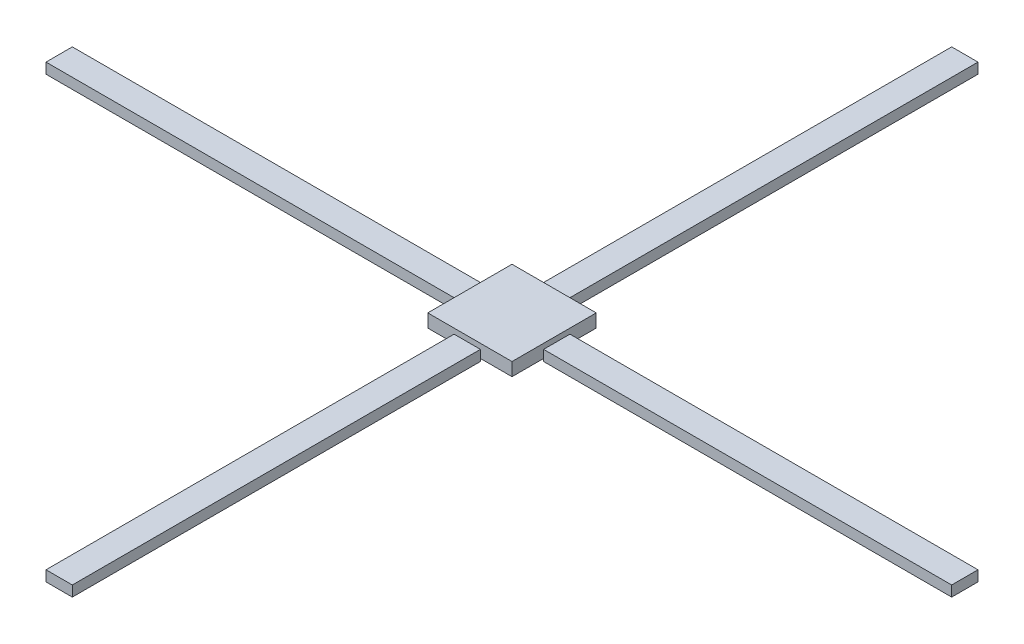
ISO-10303-21;
HEADER;
FILE_DESCRIPTION(('STEP AP214'),'2;1');
FILE_NAME('part.step','',(''),(''),'','','');
FILE_SCHEMA(('AUTOMOTIVE_DESIGN { 1 0 10303 214 1 1 1 1 }'));
ENDSEC;
DATA;
#1=APPLICATION_CONTEXT('core data for automotive mechanical design processes');
#2=APPLICATION_PROTOCOL_DEFINITION('international standard','automotive_design',2000,#1);
#3=PRODUCT_CONTEXT('',#1,'mechanical');
#4=PRODUCT('Part','Part','',(#3));
#5=PRODUCT_RELATED_PRODUCT_CATEGORY('part','',(#4));
#6=PRODUCT_DEFINITION_FORMATION('','',#4);
#7=PRODUCT_DEFINITION_CONTEXT('part definition',#1,'design');
#8=PRODUCT_DEFINITION('design','',#6,#7);
#9=PRODUCT_DEFINITION_SHAPE('','',#8);
#10=(LENGTH_UNIT() NAMED_UNIT(*) SI_UNIT(.MILLI.,.METRE.));
#11=(NAMED_UNIT(*) PLANE_ANGLE_UNIT() SI_UNIT($,.RADIAN.));
#12=(NAMED_UNIT(*) SI_UNIT($,.STERADIAN.) SOLID_ANGLE_UNIT());
#13=UNCERTAINTY_MEASURE_WITH_UNIT(LENGTH_MEASURE(1.E-05),#10,'distance_accuracy_value','');
#14=(GEOMETRIC_REPRESENTATION_CONTEXT(3) GLOBAL_UNCERTAINTY_ASSIGNED_CONTEXT((#13)) GLOBAL_UNIT_ASSIGNED_CONTEXT((#10,
#11,#12)) REPRESENTATION_CONTEXT('',''));
#15=CARTESIAN_POINT('',(0.,0.,0.));
#16=DIRECTION('',(0.,0.,1.));
#17=DIRECTION('',(1.,0.,0.));
#18=AXIS2_PLACEMENT_3D('',#15,#16,#17);
#19=CARTESIAN_POINT('',(-8000.,2500.,8000.));
#20=DIRECTION('',(1.,0.,0.));
#21=DIRECTION('',(0.,0.,-1.));
#22=AXIS2_PLACEMENT_3D('',#19,#20,#21);
#23=PLANE('',#22);
#24=DIRECTION('',(0.,0.,1.));
#25=VECTOR('',#24,1.);
#26=CARTESIAN_POINT('',(-8000.,0.,8000.));
#27=LINE('',#26,#25);
#28=CARTESIAN_POINT('',(-8000.,0.,-8000.));
#29=VERTEX_POINT('',#28);
#30=CARTESIAN_POINT('',(-8000.,0.,8000.));
#31=VERTEX_POINT('',#30);
#32=EDGE_CURVE('E114',#29,#31,#27,.T.);
#33=ORIENTED_EDGE('',*,*,#32,.T.);
#34=DIRECTION('',(0.,-1.,0.));
#35=VECTOR('',#34,1.);
#36=CARTESIAN_POINT('',(-8000.,2500.,8000.));
#37=LINE('',#36,#35);
#38=CARTESIAN_POINT('',(-8000.,2500.,8000.));
#39=VERTEX_POINT('',#38);
#40=EDGE_CURVE('E12',#39,#31,#37,.T.);
#41=ORIENTED_EDGE('',*,*,#40,.F.);
#42=DIRECTION('',(0.,0.,1.));
#43=VECTOR('',#42,1.);
#44=CARTESIAN_POINT('',(-8000.,2500.,8000.));
#45=LINE('',#44,#43);
#46=CARTESIAN_POINT('',(-8000.,2500.,-8000.));
#47=VERTEX_POINT('',#46);
#48=EDGE_CURVE('E101',#47,#39,#45,.T.);
#49=ORIENTED_EDGE('',*,*,#48,.F.);
#50=DIRECTION('',(0.,-1.,0.));
#51=VECTOR('',#50,1.);
#52=CARTESIAN_POINT('',(-8000.,2500.,-8000.));
#53=LINE('',#52,#51);
#54=EDGE_CURVE('E108',#47,#29,#53,.T.);
#55=ORIENTED_EDGE('',*,*,#54,.T.);
#56=EDGE_LOOP('',(#33,#41,#49,#55));
#57=FACE_BOUND('',#56,.T.);
#58=ADVANCED_FACE('F49',(#57),#23,.F.);
#59=CARTESIAN_POINT('',(-8000.,2500.,8000.));
#60=DIRECTION('',(0.,0.,-1.));
#61=DIRECTION('',(-1.,0.,0.));
#62=AXIS2_PLACEMENT_3D('',#59,#60,#61);
#63=PLANE('',#62);
#64=DIRECTION('',(1.,0.,0.));
#65=VECTOR('',#64,1.);
#66=CARTESIAN_POINT('',(-8000.,0.,8000.));
#67=LINE('',#66,#65);
#68=CARTESIAN_POINT('',(8000.,0.,8000.));
#69=VERTEX_POINT('',#68);
#70=EDGE_CURVE('E104',#31,#69,#67,.T.);
#71=ORIENTED_EDGE('',*,*,#70,.T.);
#72=DIRECTION('',(0.,-1.,0.));
#73=VECTOR('',#72,1.);
#74=CARTESIAN_POINT('',(8000.,2500.,8000.));
#75=LINE('',#74,#73);
#76=CARTESIAN_POINT('',(8000.,2500.,8000.));
#77=VERTEX_POINT('',#76);
#78=EDGE_CURVE('E59',#77,#69,#75,.T.);
#79=ORIENTED_EDGE('',*,*,#78,.F.);
#80=DIRECTION('',(1.,0.,0.));
#81=VECTOR('',#80,1.);
#82=CARTESIAN_POINT('',(-8000.,2500.,8000.));
#83=LINE('',#82,#81);
#84=EDGE_CURVE('E96',#39,#77,#83,.T.);
#85=ORIENTED_EDGE('',*,*,#84,.F.);
#86=ORIENTED_EDGE('',*,*,#40,.T.);
#87=EDGE_LOOP('',(#71,#79,#85,#86));
#88=FACE_BOUND('',#87,.T.);
#89=ADVANCED_FACE('F102',(#88),#63,.F.);
#90=CARTESIAN_POINT('',(8000.,2500.,8000.));
#91=DIRECTION('',(-1.,0.,0.));
#92=DIRECTION('',(0.,0.,1.));
#93=AXIS2_PLACEMENT_3D('',#90,#91,#92);
#94=PLANE('',#93);
#95=DIRECTION('',(0.,0.,-1.));
#96=VECTOR('',#95,1.);
#97=CARTESIAN_POINT('',(8000.,0.,8000.));
#98=LINE('',#97,#96);
#99=CARTESIAN_POINT('',(8000.,0.,-8000.));
#100=VERTEX_POINT('',#99);
#101=EDGE_CURVE('E81',#69,#100,#98,.T.);
#102=ORIENTED_EDGE('',*,*,#101,.T.);
#103=DIRECTION('',(0.,-1.,0.));
#104=VECTOR('',#103,1.);
#105=CARTESIAN_POINT('',(8000.,2500.,-8000.));
#106=LINE('',#105,#104);
#107=CARTESIAN_POINT('',(8000.,2500.,-8000.));
#108=VERTEX_POINT('',#107);
#109=EDGE_CURVE('E106',#108,#100,#106,.T.);
#110=ORIENTED_EDGE('',*,*,#109,.F.);
#111=DIRECTION('',(0.,0.,-1.));
#112=VECTOR('',#111,1.);
#113=CARTESIAN_POINT('',(8000.,2500.,8000.));
#114=LINE('',#113,#112);
#115=EDGE_CURVE('E97',#77,#108,#114,.T.);
#116=ORIENTED_EDGE('',*,*,#115,.F.);
#117=ORIENTED_EDGE('',*,*,#78,.T.);
#118=EDGE_LOOP('',(#102,#110,#116,#117));
#119=FACE_BOUND('',#118,.T.);
#120=ADVANCED_FACE('F110',(#119),#94,.F.);
#121=CARTESIAN_POINT('',(-8000.,2500.,-8000.));
#122=DIRECTION('',(0.,0.,1.));
#123=DIRECTION('',(1.,0.,0.));
#124=AXIS2_PLACEMENT_3D('',#121,#122,#123);
#125=PLANE('',#124);
#126=DIRECTION('',(-1.,0.,0.));
#127=VECTOR('',#126,1.);
#128=CARTESIAN_POINT('',(-8000.,0.,-8000.));
#129=LINE('',#128,#127);
#130=EDGE_CURVE('E90',#100,#29,#129,.T.);
#131=ORIENTED_EDGE('',*,*,#130,.T.);
#132=ORIENTED_EDGE('',*,*,#54,.F.);
#133=DIRECTION('',(-1.,0.,0.));
#134=VECTOR('',#133,1.);
#135=CARTESIAN_POINT('',(-8000.,2500.,-8000.));
#136=LINE('',#135,#134);
#137=EDGE_CURVE('E68',#108,#47,#136,.T.);
#138=ORIENTED_EDGE('',*,*,#137,.F.);
#139=ORIENTED_EDGE('',*,*,#109,.T.);
#140=EDGE_LOOP('',(#131,#132,#138,#139));
#141=FACE_BOUND('',#140,.T.);
#142=ADVANCED_FACE('F118',(#141),#125,.F.);
#143=CARTESIAN_POINT('',(0.,2500.,0.));
#144=DIRECTION('',(0.,-1.,0.));
#145=DIRECTION('',(0.,0.,-1.));
#146=AXIS2_PLACEMENT_3D('',#143,#144,#145);
#147=PLANE('',#146);
#148=ORIENTED_EDGE('',*,*,#48,.T.);
#149=ORIENTED_EDGE('',*,*,#84,.T.);
#150=ORIENTED_EDGE('',*,*,#115,.T.);
#151=ORIENTED_EDGE('',*,*,#137,.T.);
#152=EDGE_LOOP('',(#148,#149,#150,#151));
#153=FACE_BOUND('',#152,.T.);
#154=ADVANCED_FACE('F100',(#153),#147,.F.);
#155=CARTESIAN_POINT('',(0.,0.,0.));
#156=DIRECTION('',(0.,-1.,0.));
#157=DIRECTION('',(0.,0.,-1.));
#158=AXIS2_PLACEMENT_3D('',#155,#156,#157);
#159=PLANE('',#158);
#160=ORIENTED_EDGE('',*,*,#32,.F.);
#161=ORIENTED_EDGE('',*,*,#130,.F.);
#162=ORIENTED_EDGE('',*,*,#101,.F.);
#163=ORIENTED_EDGE('',*,*,#70,.F.);
#164=EDGE_LOOP('',(#160,#161,#162,#163));
#165=FACE_BOUND('',#164,.T.);
#166=ADVANCED_FACE('F121',(#165),#159,.T.);
#167=CLOSED_SHELL('',(#58,#89,#120,#142,#154,#166));
#168=MANIFOLD_SOLID_BREP('B2',#167);
#169=CARTESIAN_POINT('',(-2500.,2000.,86000.));
#170=DIRECTION('',(1.,0.,0.));
#171=DIRECTION('',(0.,0.,-1.));
#172=AXIS2_PLACEMENT_3D('',#169,#170,#171);
#173=PLANE('',#172);
#174=DIRECTION('',(0.,0.,1.));
#175=VECTOR('',#174,1.);
#176=CARTESIAN_POINT('',(-2500.,0.,86000.));
#177=LINE('',#176,#175);
#178=CARTESIAN_POINT('',(-2500.,0.,8500.));
#179=VERTEX_POINT('',#178);
#180=CARTESIAN_POINT('',(-2500.,0.,86000.));
#181=VERTEX_POINT('',#180);
#182=EDGE_CURVE('E48',#179,#181,#177,.T.);
#183=ORIENTED_EDGE('',*,*,#182,.T.);
#184=DIRECTION('',(0.,-1.,0.));
#185=VECTOR('',#184,1.);
#186=CARTESIAN_POINT('',(-2500.,2000.,86000.));
#187=LINE('',#186,#185);
#188=CARTESIAN_POINT('',(-2500.,2000.,86000.));
#189=VERTEX_POINT('',#188);
#190=EDGE_CURVE('E254',#189,#181,#187,.T.);
#191=ORIENTED_EDGE('',*,*,#190,.F.);
#192=DIRECTION('',(0.,0.,1.));
#193=VECTOR('',#192,1.);
#194=CARTESIAN_POINT('',(-2500.,2000.,86000.));
#195=LINE('',#194,#193);
#196=CARTESIAN_POINT('',(-2500.,2000.,8500.));
#197=VERTEX_POINT('',#196);
#198=EDGE_CURVE('E189',#197,#189,#195,.T.);
#199=ORIENTED_EDGE('',*,*,#198,.F.);
#200=DIRECTION('',(0.,-1.,0.));
#201=VECTOR('',#200,1.);
#202=CARTESIAN_POINT('',(-2500.,2000.,8500.));
#203=LINE('',#202,#201);
#204=EDGE_CURVE('E244',#197,#179,#203,.T.);
#205=ORIENTED_EDGE('',*,*,#204,.T.);
#206=EDGE_LOOP('',(#183,#191,#199,#205));
#207=FACE_BOUND('',#206,.T.);
#208=ADVANCED_FACE('F184',(#207),#173,.F.);
#209=CARTESIAN_POINT('',(-2500.,2000.,86000.));
#210=DIRECTION('',(0.,0.,-1.));
#211=DIRECTION('',(-1.,0.,0.));
#212=AXIS2_PLACEMENT_3D('',#209,#210,#211);
#213=PLANE('',#212);
#214=DIRECTION('',(1.,0.,0.));
#215=VECTOR('',#214,1.);
#216=CARTESIAN_POINT('',(-2500.,0.,86000.));
#217=LINE('',#216,#215);
#218=CARTESIAN_POINT('',(2500.,0.,86000.));
#219=VERTEX_POINT('',#218);
#220=EDGE_CURVE('E192',#181,#219,#217,.T.);
#221=ORIENTED_EDGE('',*,*,#220,.T.);
#222=DIRECTION('',(0.,-1.,0.));
#223=VECTOR('',#222,1.);
#224=CARTESIAN_POINT('',(2500.,2000.,86000.));
#225=LINE('',#224,#223);
#226=CARTESIAN_POINT('',(2500.,2000.,86000.));
#227=VERTEX_POINT('',#226);
#228=EDGE_CURVE('E239',#227,#219,#225,.T.);
#229=ORIENTED_EDGE('',*,*,#228,.F.);
#230=DIRECTION('',(1.,0.,0.));
#231=VECTOR('',#230,1.);
#232=CARTESIAN_POINT('',(-2500.,2000.,86000.));
#233=LINE('',#232,#231);
#234=EDGE_CURVE('E217',#189,#227,#233,.T.);
#235=ORIENTED_EDGE('',*,*,#234,.F.);
#236=ORIENTED_EDGE('',*,*,#190,.T.);
#237=EDGE_LOOP('',(#221,#229,#235,#236));
#238=FACE_BOUND('',#237,.T.);
#239=ADVANCED_FACE('F256',(#238),#213,.F.);
#240=CARTESIAN_POINT('',(2500.,2000.,86000.));
#241=DIRECTION('',(-1.,0.,0.));
#242=DIRECTION('',(0.,0.,1.));
#243=AXIS2_PLACEMENT_3D('',#240,#241,#242);
#244=PLANE('',#243);
#245=DIRECTION('',(0.,0.,-1.));
#246=VECTOR('',#245,1.);
#247=CARTESIAN_POINT('',(2500.,0.,86000.));
#248=LINE('',#247,#246);
#249=CARTESIAN_POINT('',(2500.,0.,8500.));
#250=VERTEX_POINT('',#249);
#251=EDGE_CURVE('E232',#219,#250,#248,.T.);
#252=ORIENTED_EDGE('',*,*,#251,.T.);
#253=DIRECTION('',(0.,-1.,0.));
#254=VECTOR('',#253,1.);
#255=CARTESIAN_POINT('',(2500.,2000.,8500.));
#256=LINE('',#255,#254);
#257=CARTESIAN_POINT('',(2500.,2000.,8500.));
#258=VERTEX_POINT('',#257);
#259=EDGE_CURVE('E240',#258,#250,#256,.T.);
#260=ORIENTED_EDGE('',*,*,#259,.F.);
#261=DIRECTION('',(0.,0.,-1.));
#262=VECTOR('',#261,1.);
#263=CARTESIAN_POINT('',(2500.,2000.,86000.));
#264=LINE('',#263,#262);
#265=EDGE_CURVE('E253',#227,#258,#264,.T.);
#266=ORIENTED_EDGE('',*,*,#265,.F.);
#267=ORIENTED_EDGE('',*,*,#228,.T.);
#268=EDGE_LOOP('',(#252,#260,#266,#267));
#269=FACE_BOUND('',#268,.T.);
#270=ADVANCED_FACE('F234',(#269),#244,.F.);
#271=CARTESIAN_POINT('',(-2500.,2000.,8500.));
#272=DIRECTION('',(0.,0.,1.));
#273=DIRECTION('',(1.,0.,0.));
#274=AXIS2_PLACEMENT_3D('',#271,#272,#273);
#275=PLANE('',#274);
#276=DIRECTION('',(-1.,0.,0.));
#277=VECTOR('',#276,1.);
#278=CARTESIAN_POINT('',(-2500.,0.,8500.));
#279=LINE('',#278,#277);
#280=EDGE_CURVE('E229',#250,#179,#279,.T.);
#281=ORIENTED_EDGE('',*,*,#280,.T.);
#282=ORIENTED_EDGE('',*,*,#204,.F.);
#283=DIRECTION('',(-1.,0.,0.));
#284=VECTOR('',#283,1.);
#285=CARTESIAN_POINT('',(-2500.,2000.,8500.));
#286=LINE('',#285,#284);
#287=EDGE_CURVE('E245',#258,#197,#286,.T.);
#288=ORIENTED_EDGE('',*,*,#287,.F.);
#289=ORIENTED_EDGE('',*,*,#259,.T.);
#290=EDGE_LOOP('',(#281,#282,#288,#289));
#291=FACE_BOUND('',#290,.T.);
#292=ADVANCED_FACE('F242',(#291),#275,.F.);
#293=CARTESIAN_POINT('',(0.,2000.,0.));
#294=DIRECTION('',(0.,-1.,0.));
#295=DIRECTION('',(0.,0.,-1.));
#296=AXIS2_PLACEMENT_3D('',#293,#294,#295);
#297=PLANE('',#296);
#298=ORIENTED_EDGE('',*,*,#198,.T.);
#299=ORIENTED_EDGE('',*,*,#234,.T.);
#300=ORIENTED_EDGE('',*,*,#265,.T.);
#301=ORIENTED_EDGE('',*,*,#287,.T.);
#302=EDGE_LOOP('',(#298,#299,#300,#301));
#303=FACE_BOUND('',#302,.T.);
#304=ADVANCED_FACE('F187',(#303),#297,.F.);
#305=CARTESIAN_POINT('',(0.,0.,0.));
#306=DIRECTION('',(0.,-1.,0.));
#307=DIRECTION('',(0.,0.,-1.));
#308=AXIS2_PLACEMENT_3D('',#305,#306,#307);
#309=PLANE('',#308);
#310=ORIENTED_EDGE('',*,*,#182,.F.);
#311=ORIENTED_EDGE('',*,*,#280,.F.);
#312=ORIENTED_EDGE('',*,*,#251,.F.);
#313=ORIENTED_EDGE('',*,*,#220,.F.);
#314=EDGE_LOOP('',(#310,#311,#312,#313));
#315=FACE_BOUND('',#314,.T.);
#316=ADVANCED_FACE('F243',(#315),#309,.T.);
#317=CLOSED_SHELL('',(#208,#239,#270,#292,#304,#316));
#318=MANIFOLD_SOLID_BREP('B6',#317);
#319=CARTESIAN_POINT('',(-2500.,2000.,-8500.));
#320=DIRECTION('',(1.,0.,0.));
#321=DIRECTION('',(0.,0.,-1.));
#322=AXIS2_PLACEMENT_3D('',#319,#320,#321);
#323=PLANE('',#322);
#324=DIRECTION('',(0.,0.,1.));
#325=VECTOR('',#324,1.);
#326=CARTESIAN_POINT('',(-2500.,0.,-8500.));
#327=LINE('',#326,#325);
#328=CARTESIAN_POINT('',(-2500.,0.,-86000.));
#329=VERTEX_POINT('',#328);
#330=CARTESIAN_POINT('',(-2500.,0.,-8500.));
#331=VERTEX_POINT('',#330);
#332=EDGE_CURVE('E185',#329,#331,#327,.T.);
#333=ORIENTED_EDGE('',*,*,#332,.T.);
#334=DIRECTION('',(0.,-1.,0.));
#335=VECTOR('',#334,1.);
#336=CARTESIAN_POINT('',(-2500.,2000.,-8500.));
#337=LINE('',#336,#335);
#338=CARTESIAN_POINT('',(-2500.,2000.,-8500.));
#339=VERTEX_POINT('',#338);
#340=EDGE_CURVE('E386',#339,#331,#337,.T.);
#341=ORIENTED_EDGE('',*,*,#340,.F.);
#342=DIRECTION('',(0.,0.,1.));
#343=VECTOR('',#342,1.);
#344=CARTESIAN_POINT('',(-2500.,2000.,-8500.));
#345=LINE('',#344,#343);
#346=CARTESIAN_POINT('',(-2500.,2000.,-86000.));
#347=VERTEX_POINT('',#346);
#348=EDGE_CURVE('E325',#347,#339,#345,.T.);
#349=ORIENTED_EDGE('',*,*,#348,.F.);
#350=DIRECTION('',(0.,-1.,0.));
#351=VECTOR('',#350,1.);
#352=CARTESIAN_POINT('',(-2500.,2000.,-86000.));
#353=LINE('',#352,#351);
#354=EDGE_CURVE('E380',#347,#329,#353,.T.);
#355=ORIENTED_EDGE('',*,*,#354,.T.);
#356=EDGE_LOOP('',(#333,#341,#349,#355));
#357=FACE_BOUND('',#356,.T.);
#358=ADVANCED_FACE('F318',(#357),#323,.F.);
#359=CARTESIAN_POINT('',(-2500.,2000.,-8500.));
#360=DIRECTION('',(0.,0.,-1.));
#361=DIRECTION('',(-1.,0.,0.));
#362=AXIS2_PLACEMENT_3D('',#359,#360,#361);
#363=PLANE('',#362);
#364=DIRECTION('',(1.,0.,0.));
#365=VECTOR('',#364,1.);
#366=CARTESIAN_POINT('',(-2500.,0.,-8500.));
#367=LINE('',#366,#365);
#368=CARTESIAN_POINT('',(2500.,0.,-8500.));
#369=VERTEX_POINT('',#368);
#370=EDGE_CURVE('E327',#331,#369,#367,.T.);
#371=ORIENTED_EDGE('',*,*,#370,.T.);
#372=DIRECTION('',(0.,-1.,0.));
#373=VECTOR('',#372,1.);
#374=CARTESIAN_POINT('',(2500.,2000.,-8500.));
#375=LINE('',#374,#373);
#376=CARTESIAN_POINT('',(2500.,2000.,-8500.));
#377=VERTEX_POINT('',#376);
#378=EDGE_CURVE('E373',#377,#369,#375,.T.);
#379=ORIENTED_EDGE('',*,*,#378,.F.);
#380=DIRECTION('',(1.,0.,0.));
#381=VECTOR('',#380,1.);
#382=CARTESIAN_POINT('',(-2500.,2000.,-8500.));
#383=LINE('',#382,#381);
#384=EDGE_CURVE('E355',#339,#377,#383,.T.);
#385=ORIENTED_EDGE('',*,*,#384,.F.);
#386=ORIENTED_EDGE('',*,*,#340,.T.);
#387=EDGE_LOOP('',(#371,#379,#385,#386));
#388=FACE_BOUND('',#387,.T.);
#389=ADVANCED_FACE('F395',(#388),#363,.F.);
#390=CARTESIAN_POINT('',(2500.,2000.,-8500.));
#391=DIRECTION('',(-1.,0.,0.));
#392=DIRECTION('',(0.,0.,1.));
#393=AXIS2_PLACEMENT_3D('',#390,#391,#392);
#394=PLANE('',#393);
#395=DIRECTION('',(0.,0.,-1.));
#396=VECTOR('',#395,1.);
#397=CARTESIAN_POINT('',(2500.,0.,-8500.));
#398=LINE('',#397,#396);
#399=CARTESIAN_POINT('',(2500.,0.,-86000.));
#400=VERTEX_POINT('',#399);
#401=EDGE_CURVE('E366',#369,#400,#398,.T.);
#402=ORIENTED_EDGE('',*,*,#401,.T.);
#403=DIRECTION('',(0.,-1.,0.));
#404=VECTOR('',#403,1.);
#405=CARTESIAN_POINT('',(2500.,2000.,-86000.));
#406=LINE('',#405,#404);
#407=CARTESIAN_POINT('',(2500.,2000.,-86000.));
#408=VERTEX_POINT('',#407);
#409=EDGE_CURVE('E371',#408,#400,#406,.T.);
#410=ORIENTED_EDGE('',*,*,#409,.F.);
#411=DIRECTION('',(0.,0.,-1.));
#412=VECTOR('',#411,1.);
#413=CARTESIAN_POINT('',(2500.,2000.,-8500.));
#414=LINE('',#413,#412);
#415=EDGE_CURVE('E384',#377,#408,#414,.T.);
#416=ORIENTED_EDGE('',*,*,#415,.F.);
#417=ORIENTED_EDGE('',*,*,#378,.T.);
#418=EDGE_LOOP('',(#402,#410,#416,#417));
#419=FACE_BOUND('',#418,.T.);
#420=ADVANCED_FACE('F369',(#419),#394,.F.);
#421=CARTESIAN_POINT('',(-2500.,2000.,-86000.));
#422=DIRECTION('',(0.,0.,1.));
#423=DIRECTION('',(1.,0.,0.));
#424=AXIS2_PLACEMENT_3D('',#421,#422,#423);
#425=PLANE('',#424);
#426=DIRECTION('',(-1.,0.,0.));
#427=VECTOR('',#426,1.);
#428=CARTESIAN_POINT('',(-2500.,0.,-86000.));
#429=LINE('',#428,#427);
#430=EDGE_CURVE('E362',#400,#329,#429,.T.);
#431=ORIENTED_EDGE('',*,*,#430,.T.);
#432=ORIENTED_EDGE('',*,*,#354,.F.);
#433=DIRECTION('',(-1.,0.,0.));
#434=VECTOR('',#433,1.);
#435=CARTESIAN_POINT('',(-2500.,2000.,-86000.));
#436=LINE('',#435,#434);
#437=EDGE_CURVE('E376',#408,#347,#436,.T.);
#438=ORIENTED_EDGE('',*,*,#437,.F.);
#439=ORIENTED_EDGE('',*,*,#409,.T.);
#440=EDGE_LOOP('',(#431,#432,#438,#439));
#441=FACE_BOUND('',#440,.T.);
#442=ADVANCED_FACE('F374',(#441),#425,.F.);
#443=CARTESIAN_POINT('',(0.,2000.,0.));
#444=DIRECTION('',(0.,-1.,0.));
#445=DIRECTION('',(0.,0.,-1.));
#446=AXIS2_PLACEMENT_3D('',#443,#444,#445);
#447=PLANE('',#446);
#448=ORIENTED_EDGE('',*,*,#348,.T.);
#449=ORIENTED_EDGE('',*,*,#384,.T.);
#450=ORIENTED_EDGE('',*,*,#415,.T.);
#451=ORIENTED_EDGE('',*,*,#437,.T.);
#452=EDGE_LOOP('',(#448,#449,#450,#451));
#453=FACE_BOUND('',#452,.T.);
#454=ADVANCED_FACE('F319',(#453),#447,.F.);
#455=CARTESIAN_POINT('',(0.,0.,0.));
#456=DIRECTION('',(0.,-1.,0.));
#457=DIRECTION('',(0.,0.,-1.));
#458=AXIS2_PLACEMENT_3D('',#455,#456,#457);
#459=PLANE('',#458);
#460=ORIENTED_EDGE('',*,*,#332,.F.);
#461=ORIENTED_EDGE('',*,*,#430,.F.);
#462=ORIENTED_EDGE('',*,*,#401,.F.);
#463=ORIENTED_EDGE('',*,*,#370,.F.);
#464=EDGE_LOOP('',(#460,#461,#462,#463));
#465=FACE_BOUND('',#464,.T.);
#466=ADVANCED_FACE('F377',(#465),#459,.T.);
#467=CLOSED_SHELL('',(#358,#389,#420,#442,#454,#466));
#468=MANIFOLD_SOLID_BREP('B45',#467);
#469=CARTESIAN_POINT('',(-86000.,2000.,2500.));
#470=DIRECTION('',(1.,0.,0.));
#471=DIRECTION('',(0.,0.,-1.));
#472=AXIS2_PLACEMENT_3D('',#469,#470,#471);
#473=PLANE('',#472);
#474=DIRECTION('',(0.,0.,1.));
#475=VECTOR('',#474,1.);
#476=CARTESIAN_POINT('',(-86000.,0.,2500.));
#477=LINE('',#476,#475);
#478=CARTESIAN_POINT('',(-86000.,0.,-2500.));
#479=VERTEX_POINT('',#478);
#480=CARTESIAN_POINT('',(-86000.,0.,2500.));
#481=VERTEX_POINT('',#480);
#482=EDGE_CURVE('E316',#479,#481,#477,.T.);
#483=ORIENTED_EDGE('',*,*,#482,.T.);
#484=DIRECTION('',(0.,-1.,0.));
#485=VECTOR('',#484,1.);
#486=CARTESIAN_POINT('',(-86000.,2000.,2500.));
#487=LINE('',#486,#485);
#488=CARTESIAN_POINT('',(-86000.,2000.,2500.));
#489=VERTEX_POINT('',#488);
#490=EDGE_CURVE('E525',#489,#481,#487,.T.);
#491=ORIENTED_EDGE('',*,*,#490,.F.);
#492=DIRECTION('',(0.,0.,1.));
#493=VECTOR('',#492,1.);
#494=CARTESIAN_POINT('',(-86000.,2000.,2500.));
#495=LINE('',#494,#493);
#496=CARTESIAN_POINT('',(-86000.,2000.,-2500.));
#497=VERTEX_POINT('',#496);
#498=EDGE_CURVE('E454',#497,#489,#495,.T.);
#499=ORIENTED_EDGE('',*,*,#498,.F.);
#500=DIRECTION('',(0.,-1.,0.));
#501=VECTOR('',#500,1.);
#502=CARTESIAN_POINT('',(-86000.,2000.,-2500.));
#503=LINE('',#502,#501);
#504=EDGE_CURVE('E509',#497,#479,#503,.T.);
#505=ORIENTED_EDGE('',*,*,#504,.T.);
#506=EDGE_LOOP('',(#483,#491,#499,#505));
#507=FACE_BOUND('',#506,.T.);
#508=ADVANCED_FACE('F453',(#507),#473,.F.);
#509=CARTESIAN_POINT('',(-86000.,2000.,2500.));
#510=DIRECTION('',(0.,0.,-1.));
#511=DIRECTION('',(-1.,0.,0.));
#512=AXIS2_PLACEMENT_3D('',#509,#510,#511);
#513=PLANE('',#512);
#514=DIRECTION('',(1.,0.,0.));
#515=VECTOR('',#514,1.);
#516=CARTESIAN_POINT('',(-86000.,0.,2500.));
#517=LINE('',#516,#515);
#518=CARTESIAN_POINT('',(-8500.,0.,2500.));
#519=VERTEX_POINT('',#518);
#520=EDGE_CURVE('E462',#481,#519,#517,.T.);
#521=ORIENTED_EDGE('',*,*,#520,.T.);
#522=DIRECTION('',(0.,-1.,0.));
#523=VECTOR('',#522,1.);
#524=CARTESIAN_POINT('',(-8500.,2000.,2500.));
#525=LINE('',#524,#523);
#526=CARTESIAN_POINT('',(-8500.,2000.,2500.));
#527=VERTEX_POINT('',#526);
#528=EDGE_CURVE('E508',#527,#519,#525,.T.);
#529=ORIENTED_EDGE('',*,*,#528,.F.);
#530=DIRECTION('',(1.,0.,0.));
#531=VECTOR('',#530,1.);
#532=CARTESIAN_POINT('',(-86000.,2000.,2500.));
#533=LINE('',#532,#531);
#534=EDGE_CURVE('E484',#489,#527,#533,.T.);
#535=ORIENTED_EDGE('',*,*,#534,.F.);
#536=ORIENTED_EDGE('',*,*,#490,.T.);
#537=EDGE_LOOP('',(#521,#529,#535,#536));
#538=FACE_BOUND('',#537,.T.);
#539=ADVANCED_FACE('F524',(#538),#513,.F.);
#540=CARTESIAN_POINT('',(-8500.,2000.,2500.));
#541=DIRECTION('',(-1.,0.,0.));
#542=DIRECTION('',(0.,0.,1.));
#543=AXIS2_PLACEMENT_3D('',#540,#541,#542);
#544=PLANE('',#543);
#545=DIRECTION('',(0.,0.,-1.));
#546=VECTOR('',#545,1.);
#547=CARTESIAN_POINT('',(-8500.,0.,2500.));
#548=LINE('',#547,#546);
#549=CARTESIAN_POINT('',(-8500.,0.,-2500.));
#550=VERTEX_POINT('',#549);
#551=EDGE_CURVE('E502',#519,#550,#548,.T.);
#552=ORIENTED_EDGE('',*,*,#551,.T.);
#553=DIRECTION('',(0.,-1.,0.));
#554=VECTOR('',#553,1.);
#555=CARTESIAN_POINT('',(-8500.,2000.,-2500.));
#556=LINE('',#555,#554);
#557=CARTESIAN_POINT('',(-8500.,2000.,-2500.));
#558=VERTEX_POINT('',#557);
#559=EDGE_CURVE('E501',#558,#550,#556,.T.);
#560=ORIENTED_EDGE('',*,*,#559,.F.);
#561=DIRECTION('',(0.,0.,-1.));
#562=VECTOR('',#561,1.);
#563=CARTESIAN_POINT('',(-8500.,2000.,2500.));
#564=LINE('',#563,#562);
#565=EDGE_CURVE('E519',#527,#558,#564,.T.);
#566=ORIENTED_EDGE('',*,*,#565,.F.);
#567=ORIENTED_EDGE('',*,*,#528,.T.);
#568=EDGE_LOOP('',(#552,#560,#566,#567));
#569=FACE_BOUND('',#568,.T.);
#570=ADVANCED_FACE('F505',(#569),#544,.F.);
#571=CARTESIAN_POINT('',(-86000.,2000.,-2500.));
#572=DIRECTION('',(0.,0.,1.));
#573=DIRECTION('',(1.,0.,0.));
#574=AXIS2_PLACEMENT_3D('',#571,#572,#573);
#575=PLANE('',#574);
#576=DIRECTION('',(-1.,0.,0.));
#577=VECTOR('',#576,1.);
#578=CARTESIAN_POINT('',(-86000.,0.,-2500.));
#579=LINE('',#578,#577);
#580=EDGE_CURVE('E494',#550,#479,#579,.T.);
#581=ORIENTED_EDGE('',*,*,#580,.T.);
#582=ORIENTED_EDGE('',*,*,#504,.F.);
#583=DIRECTION('',(-1.,0.,0.));
#584=VECTOR('',#583,1.);
#585=CARTESIAN_POINT('',(-86000.,2000.,-2500.));
#586=LINE('',#585,#584);
#587=EDGE_CURVE('E507',#558,#497,#586,.T.);
#588=ORIENTED_EDGE('',*,*,#587,.F.);
#589=ORIENTED_EDGE('',*,*,#559,.T.);
#590=EDGE_LOOP('',(#581,#582,#588,#589));
#591=FACE_BOUND('',#590,.T.);
#592=ADVANCED_FACE('F506',(#591),#575,.F.);
#593=CARTESIAN_POINT('',(0.,2000.,0.));
#594=DIRECTION('',(0.,-1.,0.));
#595=DIRECTION('',(0.,0.,-1.));
#596=AXIS2_PLACEMENT_3D('',#593,#594,#595);
#597=PLANE('',#596);
#598=ORIENTED_EDGE('',*,*,#498,.T.);
#599=ORIENTED_EDGE('',*,*,#534,.T.);
#600=ORIENTED_EDGE('',*,*,#565,.T.);
#601=ORIENTED_EDGE('',*,*,#587,.T.);
#602=EDGE_LOOP('',(#598,#599,#600,#601));
#603=FACE_BOUND('',#602,.T.);
#604=ADVANCED_FACE('F451',(#603),#597,.F.);
#605=CARTESIAN_POINT('',(0.,0.,0.));
#606=DIRECTION('',(0.,-1.,0.));
#607=DIRECTION('',(0.,0.,-1.));
#608=AXIS2_PLACEMENT_3D('',#605,#606,#607);
#609=PLANE('',#608);
#610=ORIENTED_EDGE('',*,*,#482,.F.);
#611=ORIENTED_EDGE('',*,*,#580,.F.);
#612=ORIENTED_EDGE('',*,*,#551,.F.);
#613=ORIENTED_EDGE('',*,*,#520,.F.);
#614=EDGE_LOOP('',(#610,#611,#612,#613));
#615=FACE_BOUND('',#614,.T.);
#616=ADVANCED_FACE('F515',(#615),#609,.T.);
#617=CLOSED_SHELL('',(#508,#539,#570,#592,#604,#616));
#618=MANIFOLD_SOLID_BREP('B178',#617);
#619=CARTESIAN_POINT('',(8500.,2000.,2500.));
#620=DIRECTION('',(1.,0.,0.));
#621=DIRECTION('',(0.,0.,-1.));
#622=AXIS2_PLACEMENT_3D('',#619,#620,#621);
#623=PLANE('',#622);
#624=DIRECTION('',(0.,0.,1.));
#625=VECTOR('',#624,1.);
#626=CARTESIAN_POINT('',(8500.,0.,2500.));
#627=LINE('',#626,#625);
#628=CARTESIAN_POINT('',(8500.,0.,-2500.));
#629=VERTEX_POINT('',#628);
#630=CARTESIAN_POINT('',(8500.,0.,2500.));
#631=VERTEX_POINT('',#630);
#632=EDGE_CURVE('E636',#629,#631,#627,.T.);
#633=ORIENTED_EDGE('',*,*,#632,.T.);
#634=DIRECTION('',(0.,-1.,0.));
#635=VECTOR('',#634,1.);
#636=CARTESIAN_POINT('',(8500.,2000.,2500.));
#637=LINE('',#636,#635);
#638=CARTESIAN_POINT('',(8500.,2000.,2500.));
#639=VERTEX_POINT('',#638);
#640=EDGE_CURVE('E446',#639,#631,#637,.T.);
#641=ORIENTED_EDGE('',*,*,#640,.F.);
#642=DIRECTION('',(0.,0.,1.));
#643=VECTOR('',#642,1.);
#644=CARTESIAN_POINT('',(8500.,2000.,2500.));
#645=LINE('',#644,#643);
#646=CARTESIAN_POINT('',(8500.,2000.,-2500.));
#647=VERTEX_POINT('',#646);
#648=EDGE_CURVE('E627',#647,#639,#645,.T.);
#649=ORIENTED_EDGE('',*,*,#648,.F.);
#650=DIRECTION('',(0.,-1.,0.));
#651=VECTOR('',#650,1.);
#652=CARTESIAN_POINT('',(8500.,2000.,-2500.));
#653=LINE('',#652,#651);
#654=EDGE_CURVE('E632',#647,#629,#653,.T.);
#655=ORIENTED_EDGE('',*,*,#654,.T.);
#656=EDGE_LOOP('',(#633,#641,#649,#655));
#657=FACE_BOUND('',#656,.T.);
#658=ADVANCED_FACE('F573',(#657),#623,.F.);
#659=CARTESIAN_POINT('',(8500.,2000.,2500.));
#660=DIRECTION('',(0.,0.,-1.));
#661=DIRECTION('',(-1.,0.,0.));
#662=AXIS2_PLACEMENT_3D('',#659,#660,#661);
#663=PLANE('',#662);
#664=DIRECTION('',(1.,0.,0.));
#665=VECTOR('',#664,1.);
#666=CARTESIAN_POINT('',(8500.,0.,2500.));
#667=LINE('',#666,#665);
#668=CARTESIAN_POINT('',(86000.,0.,2500.));
#669=VERTEX_POINT('',#668);
#670=EDGE_CURVE('E628',#631,#669,#667,.T.);
#671=ORIENTED_EDGE('',*,*,#670,.T.);
#672=DIRECTION('',(0.,-1.,0.));
#673=VECTOR('',#672,1.);
#674=CARTESIAN_POINT('',(86000.,2000.,2500.));
#675=LINE('',#674,#673);
#676=CARTESIAN_POINT('',(86000.,2000.,2500.));
#677=VERTEX_POINT('',#676);
#678=EDGE_CURVE('E581',#677,#669,#675,.T.);
#679=ORIENTED_EDGE('',*,*,#678,.F.);
#680=DIRECTION('',(1.,0.,0.));
#681=VECTOR('',#680,1.);
#682=CARTESIAN_POINT('',(8500.,2000.,2500.));
#683=LINE('',#682,#681);
#684=EDGE_CURVE('E622',#639,#677,#683,.T.);
#685=ORIENTED_EDGE('',*,*,#684,.F.);
#686=ORIENTED_EDGE('',*,*,#640,.T.);
#687=EDGE_LOOP('',(#671,#679,#685,#686));
#688=FACE_BOUND('',#687,.T.);
#689=ADVANCED_FACE('F626',(#688),#663,.F.);
#690=CARTESIAN_POINT('',(86000.,2000.,2500.));
#691=DIRECTION('',(-1.,0.,0.));
#692=DIRECTION('',(0.,0.,1.));
#693=AXIS2_PLACEMENT_3D('',#690,#691,#692);
#694=PLANE('',#693);
#695=DIRECTION('',(0.,0.,-1.));
#696=VECTOR('',#695,1.);
#697=CARTESIAN_POINT('',(86000.,0.,2500.));
#698=LINE('',#697,#696);
#699=CARTESIAN_POINT('',(86000.,0.,-2500.));
#700=VERTEX_POINT('',#699);
#701=EDGE_CURVE('E609',#669,#700,#698,.T.);
#702=ORIENTED_EDGE('',*,*,#701,.T.);
#703=DIRECTION('',(0.,-1.,0.));
#704=VECTOR('',#703,1.);
#705=CARTESIAN_POINT('',(86000.,2000.,-2500.));
#706=LINE('',#705,#704);
#707=CARTESIAN_POINT('',(86000.,2000.,-2500.));
#708=VERTEX_POINT('',#707);
#709=EDGE_CURVE('E633',#708,#700,#706,.T.);
#710=ORIENTED_EDGE('',*,*,#709,.F.);
#711=DIRECTION('',(0.,0.,-1.));
#712=VECTOR('',#711,1.);
#713=CARTESIAN_POINT('',(86000.,2000.,2500.));
#714=LINE('',#713,#712);
#715=EDGE_CURVE('E624',#677,#708,#714,.T.);
#716=ORIENTED_EDGE('',*,*,#715,.F.);
#717=ORIENTED_EDGE('',*,*,#678,.T.);
#718=EDGE_LOOP('',(#702,#710,#716,#717));
#719=FACE_BOUND('',#718,.T.);
#720=ADVANCED_FACE('F635',(#719),#694,.F.);
#721=CARTESIAN_POINT('',(8500.,2000.,-2500.));
#722=DIRECTION('',(0.,0.,1.));
#723=DIRECTION('',(1.,0.,0.));
#724=AXIS2_PLACEMENT_3D('',#721,#722,#723);
#725=PLANE('',#724);
#726=DIRECTION('',(-1.,0.,0.));
#727=VECTOR('',#726,1.);
#728=CARTESIAN_POINT('',(8500.,0.,-2500.));
#729=LINE('',#728,#727);
#730=EDGE_CURVE('E611',#700,#629,#729,.T.);
#731=ORIENTED_EDGE('',*,*,#730,.T.);
#732=ORIENTED_EDGE('',*,*,#654,.F.);
#733=DIRECTION('',(-1.,0.,0.));
#734=VECTOR('',#733,1.);
#735=CARTESIAN_POINT('',(8500.,2000.,-2500.));
#736=LINE('',#735,#734);
#737=EDGE_CURVE('E591',#708,#647,#736,.T.);
#738=ORIENTED_EDGE('',*,*,#737,.F.);
#739=ORIENTED_EDGE('',*,*,#709,.T.);
#740=EDGE_LOOP('',(#731,#732,#738,#739));
#741=FACE_BOUND('',#740,.T.);
#742=ADVANCED_FACE('F642',(#741),#725,.F.);
#743=CARTESIAN_POINT('',(0.,2000.,0.));
#744=DIRECTION('',(0.,-1.,0.));
#745=DIRECTION('',(0.,0.,-1.));
#746=AXIS2_PLACEMENT_3D('',#743,#744,#745);
#747=PLANE('',#746);
#748=ORIENTED_EDGE('',*,*,#648,.T.);
#749=ORIENTED_EDGE('',*,*,#684,.T.);
#750=ORIENTED_EDGE('',*,*,#715,.T.);
#751=ORIENTED_EDGE('',*,*,#737,.T.);
#752=EDGE_LOOP('',(#748,#749,#750,#751));
#753=FACE_BOUND('',#752,.T.);
#754=ADVANCED_FACE('F625',(#753),#747,.F.);
#755=CARTESIAN_POINT('',(0.,0.,0.));
#756=DIRECTION('',(0.,-1.,0.));
#757=DIRECTION('',(0.,0.,-1.));
#758=AXIS2_PLACEMENT_3D('',#755,#756,#757);
#759=PLANE('',#758);
#760=ORIENTED_EDGE('',*,*,#632,.F.);
#761=ORIENTED_EDGE('',*,*,#730,.F.);
#762=ORIENTED_EDGE('',*,*,#701,.F.);
#763=ORIENTED_EDGE('',*,*,#670,.F.);
#764=EDGE_LOOP('',(#760,#761,#762,#763));
#765=FACE_BOUND('',#764,.T.);
#766=ADVANCED_FACE('F648',(#765),#759,.T.);
#767=CLOSED_SHELL('',(#658,#689,#720,#742,#754,#766));
#768=MANIFOLD_SOLID_BREP('B309',#767);
#769=ADVANCED_BREP_SHAPE_REPRESENTATION('',(#18,#168,#318,#468,#618,#768),#14);
#770=SHAPE_DEFINITION_REPRESENTATION(#9,#769);
ENDSEC;
END-ISO-10303-21;
